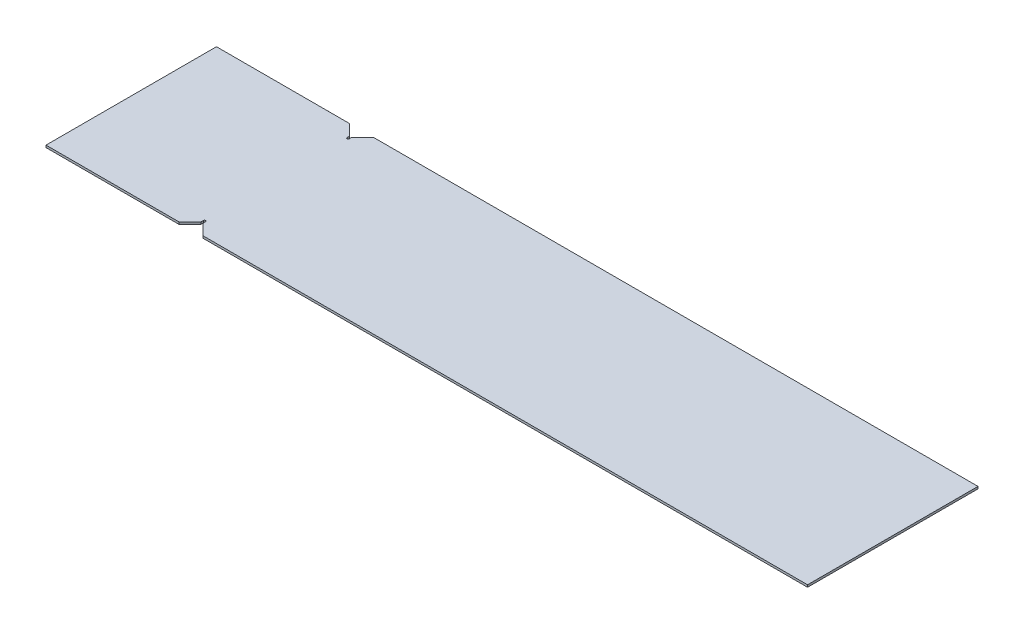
ISO-10303-21;
HEADER;
FILE_DESCRIPTION(('STEP AP214'),'2;1');
FILE_NAME('part.step','',(''),(''),'','','');
FILE_SCHEMA(('AUTOMOTIVE_DESIGN { 1 0 10303 214 1 1 1 1 }'));
ENDSEC;
DATA;
#1=APPLICATION_CONTEXT('core data for automotive mechanical design processes');
#2=APPLICATION_PROTOCOL_DEFINITION('international standard','automotive_design',2000,#1);
#3=PRODUCT_CONTEXT('',#1,'mechanical');
#4=PRODUCT('Part','Part','',(#3));
#5=PRODUCT_RELATED_PRODUCT_CATEGORY('part','',(#4));
#6=PRODUCT_DEFINITION_FORMATION('','',#4);
#7=PRODUCT_DEFINITION_CONTEXT('part definition',#1,'design');
#8=PRODUCT_DEFINITION('design','',#6,#7);
#9=PRODUCT_DEFINITION_SHAPE('','',#8);
#10=(LENGTH_UNIT() NAMED_UNIT(*) SI_UNIT(.MILLI.,.METRE.));
#11=(NAMED_UNIT(*) PLANE_ANGLE_UNIT() SI_UNIT($,.RADIAN.));
#12=(NAMED_UNIT(*) SI_UNIT($,.STERADIAN.) SOLID_ANGLE_UNIT());
#13=UNCERTAINTY_MEASURE_WITH_UNIT(LENGTH_MEASURE(1.E-05),#10,'distance_accuracy_value','');
#14=(GEOMETRIC_REPRESENTATION_CONTEXT(3) GLOBAL_UNCERTAINTY_ASSIGNED_CONTEXT((#13)) GLOBAL_UNIT_ASSIGNED_CONTEXT((#10,
#11,#12)) REPRESENTATION_CONTEXT('',''));
#15=CARTESIAN_POINT('',(0.,0.,0.));
#16=DIRECTION('',(0.,0.,1.));
#17=DIRECTION('',(1.,0.,0.));
#18=AXIS2_PLACEMENT_3D('',#15,#16,#17);
#19=CARTESIAN_POINT('',(183.5,-3.,0.));
#20=DIRECTION('',(0.,0.,1.));
#21=DIRECTION('',(1.,0.,0.));
#22=AXIS2_PLACEMENT_3D('',#19,#20,#21);
#23=PLANE('',#22);
#24=DIRECTION('',(1.,0.,0.));
#25=VECTOR('',#24,1.);
#26=CARTESIAN_POINT('',(183.5,0.,0.));
#27=LINE('',#26,#25);
#28=CARTESIAN_POINT('',(0.,0.,0.));
#29=VERTEX_POINT('',#28);
#30=CARTESIAN_POINT('',(183.5,0.,0.));
#31=VERTEX_POINT('',#30);
#32=EDGE_CURVE('E184',#29,#31,#27,.T.);
#33=ORIENTED_EDGE('',*,*,#32,.F.);
#34=DIRECTION('',(0.,1.,0.));
#35=VECTOR('',#34,1.);
#36=CARTESIAN_POINT('',(0.,-3.,0.));
#37=LINE('',#36,#35);
#38=CARTESIAN_POINT('',(0.,-3.,0.));
#39=VERTEX_POINT('',#38);
#40=EDGE_CURVE('E11',#39,#29,#37,.T.);
#41=ORIENTED_EDGE('',*,*,#40,.F.);
#42=DIRECTION('',(1.,0.,0.));
#43=VECTOR('',#42,1.);
#44=CARTESIAN_POINT('',(183.5,-3.,0.));
#45=LINE('',#44,#43);
#46=CARTESIAN_POINT('',(183.5,-3.,0.));
#47=VERTEX_POINT('',#46);
#48=EDGE_CURVE('E228',#39,#47,#45,.T.);
#49=ORIENTED_EDGE('',*,*,#48,.T.);
#50=DIRECTION('',(0.,1.,0.));
#51=VECTOR('',#50,1.);
#52=CARTESIAN_POINT('',(183.5,-3.,0.));
#53=LINE('',#52,#51);
#54=EDGE_CURVE('E42',#47,#31,#53,.T.);
#55=ORIENTED_EDGE('',*,*,#54,.T.);
#56=EDGE_LOOP('',(#33,#41,#49,#55));
#57=FACE_BOUND('',#56,.T.);
#58=ADVANCED_FACE('F39',(#57),#23,.T.);
#59=CARTESIAN_POINT('',(0.,-3.,0.));
#60=DIRECTION('',(-1.,0.,0.));
#61=DIRECTION('',(0.,0.,1.));
#62=AXIS2_PLACEMENT_3D('',#59,#60,#61);
#63=PLANE('',#62);
#64=DIRECTION('',(0.,0.,1.));
#65=VECTOR('',#64,1.);
#66=CARTESIAN_POINT('',(0.,0.,0.));
#67=LINE('',#66,#65);
#68=CARTESIAN_POINT('',(0.,0.,-235.));
#69=VERTEX_POINT('',#68);
#70=EDGE_CURVE('E226',#69,#29,#67,.T.);
#71=ORIENTED_EDGE('',*,*,#70,.F.);
#72=DIRECTION('',(0.,1.,0.));
#73=VECTOR('',#72,1.);
#74=CARTESIAN_POINT('',(0.,-3.,-235.));
#75=LINE('',#74,#73);
#76=CARTESIAN_POINT('',(0.,-3.,-235.));
#77=VERTEX_POINT('',#76);
#78=EDGE_CURVE('E48',#77,#69,#75,.T.);
#79=ORIENTED_EDGE('',*,*,#78,.F.);
#80=DIRECTION('',(0.,0.,1.));
#81=VECTOR('',#80,1.);
#82=CARTESIAN_POINT('',(0.,-3.,0.));
#83=LINE('',#82,#81);
#84=EDGE_CURVE('E174',#77,#39,#83,.T.);
#85=ORIENTED_EDGE('',*,*,#84,.T.);
#86=ORIENTED_EDGE('',*,*,#40,.T.);
#87=EDGE_LOOP('',(#71,#79,#85,#86));
#88=FACE_BOUND('',#87,.T.);
#89=ADVANCED_FACE('F256',(#88),#63,.T.);
#90=CARTESIAN_POINT('',(183.5,-3.,-235.));
#91=DIRECTION('',(0.,0.,-1.));
#92=DIRECTION('',(-1.,0.,0.));
#93=AXIS2_PLACEMENT_3D('',#90,#91,#92);
#94=PLANE('',#93);
#95=DIRECTION('',(-1.,0.,0.));
#96=VECTOR('',#95,1.);
#97=CARTESIAN_POINT('',(183.5,0.,-235.));
#98=LINE('',#97,#96);
#99=CARTESIAN_POINT('',(183.5,0.,-235.));
#100=VERTEX_POINT('',#99);
#101=EDGE_CURVE('E161',#100,#69,#98,.T.);
#102=ORIENTED_EDGE('',*,*,#101,.F.);
#103=DIRECTION('',(0.,1.,0.));
#104=VECTOR('',#103,1.);
#105=CARTESIAN_POINT('',(183.5,-3.,-235.));
#106=LINE('',#105,#104);
#107=CARTESIAN_POINT('',(183.5,-3.,-235.));
#108=VERTEX_POINT('',#107);
#109=EDGE_CURVE('E156',#108,#100,#106,.T.);
#110=ORIENTED_EDGE('',*,*,#109,.F.);
#111=DIRECTION('',(-1.,0.,0.));
#112=VECTOR('',#111,1.);
#113=CARTESIAN_POINT('',(183.5,-3.,-235.));
#114=LINE('',#113,#112);
#115=EDGE_CURVE('E159',#108,#77,#114,.T.);
#116=ORIENTED_EDGE('',*,*,#115,.T.);
#117=ORIENTED_EDGE('',*,*,#78,.T.);
#118=EDGE_LOOP('',(#102,#110,#116,#117));
#119=FACE_BOUND('',#118,.T.);
#120=ADVANCED_FACE('F158',(#119),#94,.T.);
#121=CARTESIAN_POINT('',(183.5,-3.,-235.));
#122=DIRECTION('',(0.707106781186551,0.,-0.707106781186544));
#123=DIRECTION('',(-0.707106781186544,0.,-0.707106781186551));
#124=AXIS2_PLACEMENT_3D('',#121,#122,#123);
#125=PLANE('',#124);
#126=DIRECTION('',(-0.707106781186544,0.,-0.707106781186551));
#127=VECTOR('',#126,1.);
#128=CARTESIAN_POINT('',(183.5,0.,-235.));
#129=LINE('',#128,#127);
#130=CARTESIAN_POINT('',(198.5,0.,-220.));
#131=VERTEX_POINT('',#130);
#132=EDGE_CURVE('E223',#131,#100,#129,.T.);
#133=ORIENTED_EDGE('',*,*,#132,.F.);
#134=DIRECTION('',(0.,1.,0.));
#135=VECTOR('',#134,1.);
#136=CARTESIAN_POINT('',(198.5,-3.,-220.));
#137=LINE('',#136,#135);
#138=CARTESIAN_POINT('',(198.5,-3.,-220.));
#139=VERTEX_POINT('',#138);
#140=EDGE_CURVE('E166',#139,#131,#137,.T.);
#141=ORIENTED_EDGE('',*,*,#140,.F.);
#142=DIRECTION('',(-0.707106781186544,0.,-0.707106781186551));
#143=VECTOR('',#142,1.);
#144=CARTESIAN_POINT('',(183.5,-3.,-235.));
#145=LINE('',#144,#143);
#146=EDGE_CURVE('E172',#139,#108,#145,.T.);
#147=ORIENTED_EDGE('',*,*,#146,.T.);
#148=ORIENTED_EDGE('',*,*,#109,.T.);
#149=EDGE_LOOP('',(#133,#141,#147,#148));
#150=FACE_BOUND('',#149,.T.);
#151=ADVANCED_FACE('F176',(#150),#125,.T.);
#152=CARTESIAN_POINT('',(198.5,-3.,-220.));
#153=DIRECTION('',(1.,0.,0.));
#154=DIRECTION('',(0.,0.,-1.));
#155=AXIS2_PLACEMENT_3D('',#152,#153,#154);
#156=PLANE('',#155);
#157=DIRECTION('',(0.,0.,-1.));
#158=VECTOR('',#157,1.);
#159=CARTESIAN_POINT('',(198.5,0.,-220.));
#160=LINE('',#159,#158);
#161=CARTESIAN_POINT('',(198.5,0.,-216.5));
#162=VERTEX_POINT('',#161);
#163=EDGE_CURVE('E220',#162,#131,#160,.T.);
#164=ORIENTED_EDGE('',*,*,#163,.F.);
#165=DIRECTION('',(0.,1.,0.));
#166=VECTOR('',#165,1.);
#167=CARTESIAN_POINT('',(198.5,-3.,-216.5));
#168=LINE('',#167,#166);
#169=CARTESIAN_POINT('',(198.5,-3.,-216.5));
#170=VERTEX_POINT('',#169);
#171=EDGE_CURVE('E232',#170,#162,#168,.T.);
#172=ORIENTED_EDGE('',*,*,#171,.F.);
#173=DIRECTION('',(0.,0.,-1.));
#174=VECTOR('',#173,1.);
#175=CARTESIAN_POINT('',(198.5,-3.,-220.));
#176=LINE('',#175,#174);
#177=EDGE_CURVE('E177',#170,#139,#176,.T.);
#178=ORIENTED_EDGE('',*,*,#177,.T.);
#179=ORIENTED_EDGE('',*,*,#140,.T.);
#180=EDGE_LOOP('',(#164,#172,#178,#179));
#181=FACE_BOUND('',#180,.T.);
#182=ADVANCED_FACE('F269',(#181),#156,.T.);
#183=CARTESIAN_POINT('',(200.,-3.,-216.5));
#184=DIRECTION('',(0.,1.,0.));
#185=DIRECTION('',(0.,0.,1.));
#186=AXIS2_PLACEMENT_3D('',#183,#184,#185);
#187=CYLINDRICAL_SURFACE('',#186,1.5);
#188=CARTESIAN_POINT('',(200.,0.,-216.5));
#189=DIRECTION('',(0.,-1.,0.));
#190=DIRECTION('',(0.,0.,-1.));
#191=AXIS2_PLACEMENT_3D('',#188,#189,#190);
#192=CIRCLE('',#191,1.5);
#193=CARTESIAN_POINT('',(201.5,0.,-216.5));
#194=VERTEX_POINT('',#193);
#195=EDGE_CURVE('E217',#194,#162,#192,.T.);
#196=ORIENTED_EDGE('',*,*,#195,.F.);
#197=DIRECTION('',(0.,1.,0.));
#198=VECTOR('',#197,1.);
#199=CARTESIAN_POINT('',(201.5,-3.,-216.5));
#200=LINE('',#199,#198);
#201=CARTESIAN_POINT('',(201.5,-3.,-216.5));
#202=VERTEX_POINT('',#201);
#203=EDGE_CURVE('E234',#202,#194,#200,.T.);
#204=ORIENTED_EDGE('',*,*,#203,.F.);
#205=CARTESIAN_POINT('',(200.,-3.,-216.5));
#206=DIRECTION('',(0.,-1.,0.));
#207=DIRECTION('',(0.,0.,-1.));
#208=AXIS2_PLACEMENT_3D('',#205,#206,#207);
#209=CIRCLE('',#208,1.5);
#210=EDGE_CURVE('E179',#202,#170,#209,.T.);
#211=ORIENTED_EDGE('',*,*,#210,.T.);
#212=ORIENTED_EDGE('',*,*,#171,.T.);
#213=EDGE_LOOP('',(#196,#204,#211,#212));
#214=FACE_BOUND('',#213,.T.);
#215=ADVANCED_FACE('F272',(#214),#187,.F.);
#216=CARTESIAN_POINT('',(201.5,-3.,-220.));
#217=DIRECTION('',(-1.,0.,0.));
#218=DIRECTION('',(0.,0.,1.));
#219=AXIS2_PLACEMENT_3D('',#216,#217,#218);
#220=PLANE('',#219);
#221=DIRECTION('',(0.,0.,1.));
#222=VECTOR('',#221,1.);
#223=CARTESIAN_POINT('',(201.5,0.,-220.));
#224=LINE('',#223,#222);
#225=CARTESIAN_POINT('',(201.5,0.,-220.));
#226=VERTEX_POINT('',#225);
#227=EDGE_CURVE('E214',#226,#194,#224,.T.);
#228=ORIENTED_EDGE('',*,*,#227,.F.);
#229=DIRECTION('',(0.,1.,0.));
#230=VECTOR('',#229,1.);
#231=CARTESIAN_POINT('',(201.5,-3.,-220.));
#232=LINE('',#231,#230);
#233=CARTESIAN_POINT('',(201.5,-3.,-220.));
#234=VERTEX_POINT('',#233);
#235=EDGE_CURVE('E236',#234,#226,#232,.T.);
#236=ORIENTED_EDGE('',*,*,#235,.F.);
#237=DIRECTION('',(0.,0.,1.));
#238=VECTOR('',#237,1.);
#239=CARTESIAN_POINT('',(201.5,-3.,-220.));
#240=LINE('',#239,#238);
#241=EDGE_CURVE('E489',#234,#202,#240,.T.);
#242=ORIENTED_EDGE('',*,*,#241,.T.);
#243=ORIENTED_EDGE('',*,*,#203,.T.);
#244=EDGE_LOOP('',(#228,#236,#242,#243));
#245=FACE_BOUND('',#244,.T.);
#246=ADVANCED_FACE('F276',(#245),#220,.T.);
#247=CARTESIAN_POINT('',(216.5,-3.,-235.));
#248=DIRECTION('',(-0.707106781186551,0.,-0.707106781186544));
#249=DIRECTION('',(-0.707106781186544,0.,0.707106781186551));
#250=AXIS2_PLACEMENT_3D('',#247,#248,#249);
#251=PLANE('',#250);
#252=DIRECTION('',(-0.707106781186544,0.,0.707106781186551));
#253=VECTOR('',#252,1.);
#254=CARTESIAN_POINT('',(216.5,0.,-235.));
#255=LINE('',#254,#253);
#256=CARTESIAN_POINT('',(216.5,0.,-235.));
#257=VERTEX_POINT('',#256);
#258=EDGE_CURVE('E211',#257,#226,#255,.T.);
#259=ORIENTED_EDGE('',*,*,#258,.F.);
#260=DIRECTION('',(0.,1.,0.));
#261=VECTOR('',#260,1.);
#262=CARTESIAN_POINT('',(216.5,-3.,-235.));
#263=LINE('',#262,#261);
#264=CARTESIAN_POINT('',(216.5,-3.,-235.));
#265=VERTEX_POINT('',#264);
#266=EDGE_CURVE('E238',#265,#257,#263,.T.);
#267=ORIENTED_EDGE('',*,*,#266,.F.);
#268=DIRECTION('',(-0.707106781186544,0.,0.707106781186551));
#269=VECTOR('',#268,1.);
#270=CARTESIAN_POINT('',(216.5,-3.,-235.));
#271=LINE('',#270,#269);
#272=EDGE_CURVE('E485',#265,#234,#271,.T.);
#273=ORIENTED_EDGE('',*,*,#272,.T.);
#274=ORIENTED_EDGE('',*,*,#235,.T.);
#275=EDGE_LOOP('',(#259,#267,#273,#274));
#276=FACE_BOUND('',#275,.T.);
#277=ADVANCED_FACE('F280',(#276),#251,.T.);
#278=CARTESIAN_POINT('',(216.5,-3.,-235.));
#279=DIRECTION('',(0.,0.,-1.));
#280=DIRECTION('',(-1.,0.,0.));
#281=AXIS2_PLACEMENT_3D('',#278,#279,#280);
#282=PLANE('',#281);
#283=DIRECTION('',(-1.,0.,0.));
#284=VECTOR('',#283,1.);
#285=CARTESIAN_POINT('',(216.5,0.,-235.));
#286=LINE('',#285,#284);
#287=CARTESIAN_POINT('',(1050.,0.,-235.));
#288=VERTEX_POINT('',#287);
#289=EDGE_CURVE('E208',#288,#257,#286,.T.);
#290=ORIENTED_EDGE('',*,*,#289,.F.);
#291=DIRECTION('',(0.,1.,0.));
#292=VECTOR('',#291,1.);
#293=CARTESIAN_POINT('',(1050.,-3.,-235.));
#294=LINE('',#293,#292);
#295=CARTESIAN_POINT('',(1050.,-3.,-235.));
#296=VERTEX_POINT('',#295);
#297=EDGE_CURVE('E240',#296,#288,#294,.T.);
#298=ORIENTED_EDGE('',*,*,#297,.F.);
#299=DIRECTION('',(-1.,0.,0.));
#300=VECTOR('',#299,1.);
#301=CARTESIAN_POINT('',(216.5,-3.,-235.));
#302=LINE('',#301,#300);
#303=EDGE_CURVE('E496',#296,#265,#302,.T.);
#304=ORIENTED_EDGE('',*,*,#303,.T.);
#305=ORIENTED_EDGE('',*,*,#266,.T.);
#306=EDGE_LOOP('',(#290,#298,#304,#305));
#307=FACE_BOUND('',#306,.T.);
#308=ADVANCED_FACE('F284',(#307),#282,.T.);
#309=CARTESIAN_POINT('',(1050.,-3.,0.));
#310=DIRECTION('',(1.,0.,0.));
#311=DIRECTION('',(0.,0.,-1.));
#312=AXIS2_PLACEMENT_3D('',#309,#310,#311);
#313=PLANE('',#312);
#314=DIRECTION('',(0.,0.,-1.));
#315=VECTOR('',#314,1.);
#316=CARTESIAN_POINT('',(1050.,0.,0.));
#317=LINE('',#316,#315);
#318=CARTESIAN_POINT('',(1050.,0.,0.));
#319=VERTEX_POINT('',#318);
#320=EDGE_CURVE('E205',#319,#288,#317,.T.);
#321=ORIENTED_EDGE('',*,*,#320,.F.);
#322=DIRECTION('',(0.,1.,0.));
#323=VECTOR('',#322,1.);
#324=CARTESIAN_POINT('',(1050.,-3.,0.));
#325=LINE('',#324,#323);
#326=CARTESIAN_POINT('',(1050.,-3.,0.));
#327=VERTEX_POINT('',#326);
#328=EDGE_CURVE('E242',#327,#319,#325,.T.);
#329=ORIENTED_EDGE('',*,*,#328,.F.);
#330=DIRECTION('',(0.,0.,-1.));
#331=VECTOR('',#330,1.);
#332=CARTESIAN_POINT('',(1050.,-3.,0.));
#333=LINE('',#332,#331);
#334=EDGE_CURVE('E478',#327,#296,#333,.T.);
#335=ORIENTED_EDGE('',*,*,#334,.T.);
#336=ORIENTED_EDGE('',*,*,#297,.T.);
#337=EDGE_LOOP('',(#321,#329,#335,#336));
#338=FACE_BOUND('',#337,.T.);
#339=ADVANCED_FACE('F288',(#338),#313,.T.);
#340=CARTESIAN_POINT('',(216.5,-3.,0.));
#341=DIRECTION('',(0.,0.,1.));
#342=DIRECTION('',(1.,0.,0.));
#343=AXIS2_PLACEMENT_3D('',#340,#341,#342);
#344=PLANE('',#343);
#345=DIRECTION('',(1.,0.,0.));
#346=VECTOR('',#345,1.);
#347=CARTESIAN_POINT('',(216.5,0.,0.));
#348=LINE('',#347,#346);
#349=CARTESIAN_POINT('',(216.5,0.,0.));
#350=VERTEX_POINT('',#349);
#351=EDGE_CURVE('E202',#350,#319,#348,.T.);
#352=ORIENTED_EDGE('',*,*,#351,.F.);
#353=DIRECTION('',(0.,1.,0.));
#354=VECTOR('',#353,1.);
#355=CARTESIAN_POINT('',(216.5,-3.,0.));
#356=LINE('',#355,#354);
#357=CARTESIAN_POINT('',(216.5,-3.,0.));
#358=VERTEX_POINT('',#357);
#359=EDGE_CURVE('E244',#358,#350,#356,.T.);
#360=ORIENTED_EDGE('',*,*,#359,.F.);
#361=DIRECTION('',(1.,0.,0.));
#362=VECTOR('',#361,1.);
#363=CARTESIAN_POINT('',(216.5,-3.,0.));
#364=LINE('',#363,#362);
#365=EDGE_CURVE('E474',#358,#327,#364,.T.);
#366=ORIENTED_EDGE('',*,*,#365,.T.);
#367=ORIENTED_EDGE('',*,*,#328,.T.);
#368=EDGE_LOOP('',(#352,#360,#366,#367));
#369=FACE_BOUND('',#368,.T.);
#370=ADVANCED_FACE('F292',(#369),#344,.T.);
#371=CARTESIAN_POINT('',(216.5,-3.,0.));
#372=DIRECTION('',(-0.707106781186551,0.,0.707106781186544));
#373=DIRECTION('',(0.707106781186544,0.,0.707106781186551));
#374=AXIS2_PLACEMENT_3D('',#371,#372,#373);
#375=PLANE('',#374);
#376=DIRECTION('',(0.707106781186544,0.,0.707106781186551));
#377=VECTOR('',#376,1.);
#378=CARTESIAN_POINT('',(216.5,0.,0.));
#379=LINE('',#378,#377);
#380=CARTESIAN_POINT('',(201.5,0.,-15.));
#381=VERTEX_POINT('',#380);
#382=EDGE_CURVE('E199',#381,#350,#379,.T.);
#383=ORIENTED_EDGE('',*,*,#382,.F.);
#384=DIRECTION('',(0.,1.,0.));
#385=VECTOR('',#384,1.);
#386=CARTESIAN_POINT('',(201.5,-3.,-15.));
#387=LINE('',#386,#385);
#388=CARTESIAN_POINT('',(201.5,-3.,-15.));
#389=VERTEX_POINT('',#388);
#390=EDGE_CURVE('E246',#389,#381,#387,.T.);
#391=ORIENTED_EDGE('',*,*,#390,.F.);
#392=DIRECTION('',(0.707106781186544,0.,0.707106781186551));
#393=VECTOR('',#392,1.);
#394=CARTESIAN_POINT('',(216.5,-3.,0.));
#395=LINE('',#394,#393);
#396=EDGE_CURVE('E500',#389,#358,#395,.T.);
#397=ORIENTED_EDGE('',*,*,#396,.T.);
#398=ORIENTED_EDGE('',*,*,#359,.T.);
#399=EDGE_LOOP('',(#383,#391,#397,#398));
#400=FACE_BOUND('',#399,.T.);
#401=ADVANCED_FACE('F296',(#400),#375,.T.);
#402=CARTESIAN_POINT('',(201.5,-3.,-15.));
#403=DIRECTION('',(-1.,0.,0.));
#404=DIRECTION('',(0.,0.,1.));
#405=AXIS2_PLACEMENT_3D('',#402,#403,#404);
#406=PLANE('',#405);
#407=DIRECTION('',(0.,0.,1.));
#408=VECTOR('',#407,1.);
#409=CARTESIAN_POINT('',(201.5,0.,-15.));
#410=LINE('',#409,#408);
#411=CARTESIAN_POINT('',(201.5,0.,-18.5));
#412=VERTEX_POINT('',#411);
#413=EDGE_CURVE('E196',#412,#381,#410,.T.);
#414=ORIENTED_EDGE('',*,*,#413,.F.);
#415=DIRECTION('',(0.,1.,0.));
#416=VECTOR('',#415,1.);
#417=CARTESIAN_POINT('',(201.5,-3.,-18.5));
#418=LINE('',#417,#416);
#419=CARTESIAN_POINT('',(201.5,-3.,-18.5));
#420=VERTEX_POINT('',#419);
#421=EDGE_CURVE('E248',#420,#412,#418,.T.);
#422=ORIENTED_EDGE('',*,*,#421,.F.);
#423=DIRECTION('',(0.,0.,1.));
#424=VECTOR('',#423,1.);
#425=CARTESIAN_POINT('',(201.5,-3.,-15.));
#426=LINE('',#425,#424);
#427=EDGE_CURVE('E467',#420,#389,#426,.T.);
#428=ORIENTED_EDGE('',*,*,#427,.T.);
#429=ORIENTED_EDGE('',*,*,#390,.T.);
#430=EDGE_LOOP('',(#414,#422,#428,#429));
#431=FACE_BOUND('',#430,.T.);
#432=ADVANCED_FACE('F300',(#431),#406,.T.);
#433=CARTESIAN_POINT('',(200.,-3.,-18.5));
#434=DIRECTION('',(0.,1.,0.));
#435=DIRECTION('',(0.,0.,1.));
#436=AXIS2_PLACEMENT_3D('',#433,#434,#435);
#437=CYLINDRICAL_SURFACE('',#436,1.5);
#438=CARTESIAN_POINT('',(200.,0.,-18.5));
#439=DIRECTION('',(0.,-1.,0.));
#440=DIRECTION('',(0.,0.,1.));
#441=AXIS2_PLACEMENT_3D('',#438,#439,#440);
#442=CIRCLE('',#441,1.5);
#443=CARTESIAN_POINT('',(198.5,0.,-18.5));
#444=VERTEX_POINT('',#443);
#445=EDGE_CURVE('E193',#444,#412,#442,.T.);
#446=ORIENTED_EDGE('',*,*,#445,.F.);
#447=DIRECTION('',(0.,1.,0.));
#448=VECTOR('',#447,1.);
#449=CARTESIAN_POINT('',(198.5,-3.,-18.5));
#450=LINE('',#449,#448);
#451=CARTESIAN_POINT('',(198.5,-3.,-18.5));
#452=VERTEX_POINT('',#451);
#453=EDGE_CURVE('E250',#452,#444,#450,.T.);
#454=ORIENTED_EDGE('',*,*,#453,.F.);
#455=CARTESIAN_POINT('',(200.,-3.,-18.5));
#456=DIRECTION('',(0.,-1.,0.));
#457=DIRECTION('',(0.,0.,1.));
#458=AXIS2_PLACEMENT_3D('',#455,#456,#457);
#459=CIRCLE('',#458,1.5);
#460=EDGE_CURVE('E463',#452,#420,#459,.T.);
#461=ORIENTED_EDGE('',*,*,#460,.T.);
#462=ORIENTED_EDGE('',*,*,#421,.T.);
#463=EDGE_LOOP('',(#446,#454,#461,#462));
#464=FACE_BOUND('',#463,.T.);
#465=ADVANCED_FACE('F304',(#464),#437,.F.);
#466=CARTESIAN_POINT('',(198.5,-3.,-15.));
#467=DIRECTION('',(1.,0.,0.));
#468=DIRECTION('',(0.,0.,-1.));
#469=AXIS2_PLACEMENT_3D('',#466,#467,#468);
#470=PLANE('',#469);
#471=DIRECTION('',(0.,0.,-1.));
#472=VECTOR('',#471,1.);
#473=CARTESIAN_POINT('',(198.5,0.,-15.));
#474=LINE('',#473,#472);
#475=CARTESIAN_POINT('',(198.5,0.,-15.));
#476=VERTEX_POINT('',#475);
#477=EDGE_CURVE('E190',#476,#444,#474,.T.);
#478=ORIENTED_EDGE('',*,*,#477,.F.);
#479=DIRECTION('',(0.,1.,0.));
#480=VECTOR('',#479,1.);
#481=CARTESIAN_POINT('',(198.5,-3.,-15.));
#482=LINE('',#481,#480);
#483=CARTESIAN_POINT('',(198.5,-3.,-15.));
#484=VERTEX_POINT('',#483);
#485=EDGE_CURVE('E251',#484,#476,#482,.T.);
#486=ORIENTED_EDGE('',*,*,#485,.F.);
#487=DIRECTION('',(0.,0.,-1.));
#488=VECTOR('',#487,1.);
#489=CARTESIAN_POINT('',(198.5,-3.,-15.));
#490=LINE('',#489,#488);
#491=EDGE_CURVE('E504',#484,#452,#490,.T.);
#492=ORIENTED_EDGE('',*,*,#491,.T.);
#493=ORIENTED_EDGE('',*,*,#453,.T.);
#494=EDGE_LOOP('',(#478,#486,#492,#493));
#495=FACE_BOUND('',#494,.T.);
#496=ADVANCED_FACE('F308',(#495),#470,.T.);
#497=CARTESIAN_POINT('',(183.5,-3.,0.));
#498=DIRECTION('',(0.707106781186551,0.,0.707106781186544));
#499=DIRECTION('',(0.707106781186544,0.,-0.707106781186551));
#500=AXIS2_PLACEMENT_3D('',#497,#498,#499);
#501=PLANE('',#500);
#502=DIRECTION('',(0.707106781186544,0.,-0.707106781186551));
#503=VECTOR('',#502,1.);
#504=CARTESIAN_POINT('',(183.5,0.,0.));
#505=LINE('',#504,#503);
#506=EDGE_CURVE('E187',#31,#476,#505,.T.);
#507=ORIENTED_EDGE('',*,*,#506,.F.);
#508=ORIENTED_EDGE('',*,*,#54,.F.);
#509=DIRECTION('',(0.707106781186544,0.,-0.707106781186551));
#510=VECTOR('',#509,1.);
#511=CARTESIAN_POINT('',(183.5,-3.,0.));
#512=LINE('',#511,#510);
#513=EDGE_CURVE('E506',#47,#484,#512,.T.);
#514=ORIENTED_EDGE('',*,*,#513,.T.);
#515=ORIENTED_EDGE('',*,*,#485,.T.);
#516=EDGE_LOOP('',(#507,#508,#514,#515));
#517=FACE_BOUND('',#516,.T.);
#518=ADVANCED_FACE('F253',(#517),#501,.T.);
#519=CARTESIAN_POINT('',(200.,-3.,-216.5));
#520=DIRECTION('',(0.,-1.,0.));
#521=DIRECTION('',(0.,0.,-1.));
#522=AXIS2_PLACEMENT_3D('',#519,#520,#521);
#523=PLANE('',#522);
#524=ORIENTED_EDGE('',*,*,#48,.F.);
#525=ORIENTED_EDGE('',*,*,#84,.F.);
#526=ORIENTED_EDGE('',*,*,#115,.F.);
#527=ORIENTED_EDGE('',*,*,#146,.F.);
#528=ORIENTED_EDGE('',*,*,#177,.F.);
#529=ORIENTED_EDGE('',*,*,#210,.F.);
#530=ORIENTED_EDGE('',*,*,#241,.F.);
#531=ORIENTED_EDGE('',*,*,#272,.F.);
#532=ORIENTED_EDGE('',*,*,#303,.F.);
#533=ORIENTED_EDGE('',*,*,#334,.F.);
#534=ORIENTED_EDGE('',*,*,#365,.F.);
#535=ORIENTED_EDGE('',*,*,#396,.F.);
#536=ORIENTED_EDGE('',*,*,#427,.F.);
#537=ORIENTED_EDGE('',*,*,#460,.F.);
#538=ORIENTED_EDGE('',*,*,#491,.F.);
#539=ORIENTED_EDGE('',*,*,#513,.F.);
#540=EDGE_LOOP('',(#524,#525,#526,#527,#528,#529,#530,#531,#532,#533,#534,#535,#536,#537,#538,#539));
#541=FACE_BOUND('',#540,.T.);
#542=ADVANCED_FACE('F170',(#541),#523,.T.);
#543=CARTESIAN_POINT('',(200.,0.,-216.5));
#544=DIRECTION('',(0.,-1.,0.));
#545=DIRECTION('',(0.,0.,-1.));
#546=AXIS2_PLACEMENT_3D('',#543,#544,#545);
#547=PLANE('',#546);
#548=ORIENTED_EDGE('',*,*,#32,.T.);
#549=ORIENTED_EDGE('',*,*,#506,.T.);
#550=ORIENTED_EDGE('',*,*,#477,.T.);
#551=ORIENTED_EDGE('',*,*,#445,.T.);
#552=ORIENTED_EDGE('',*,*,#413,.T.);
#553=ORIENTED_EDGE('',*,*,#382,.T.);
#554=ORIENTED_EDGE('',*,*,#351,.T.);
#555=ORIENTED_EDGE('',*,*,#320,.T.);
#556=ORIENTED_EDGE('',*,*,#289,.T.);
#557=ORIENTED_EDGE('',*,*,#258,.T.);
#558=ORIENTED_EDGE('',*,*,#227,.T.);
#559=ORIENTED_EDGE('',*,*,#195,.T.);
#560=ORIENTED_EDGE('',*,*,#163,.T.);
#561=ORIENTED_EDGE('',*,*,#132,.T.);
#562=ORIENTED_EDGE('',*,*,#101,.T.);
#563=ORIENTED_EDGE('',*,*,#70,.T.);
#564=EDGE_LOOP('',(#548,#549,#550,#551,#552,#553,#554,#555,#556,#557,#558,#559,#560,#561,#562,#563));
#565=FACE_BOUND('',#564,.T.);
#566=ADVANCED_FACE('F255',(#565),#547,.F.);
#567=CLOSED_SHELL('',(#58,#89,#120,#151,#182,#215,#246,#277,#308,#339,#370,#401,#432,#465,#496,
#518,#542,#566));
#568=MANIFOLD_SOLID_BREP('B2',#567);
#569=ADVANCED_BREP_SHAPE_REPRESENTATION('',(#18,#568),#14);
#570=SHAPE_DEFINITION_REPRESENTATION(#9,#569);
ENDSEC;
END-ISO-10303-21;
